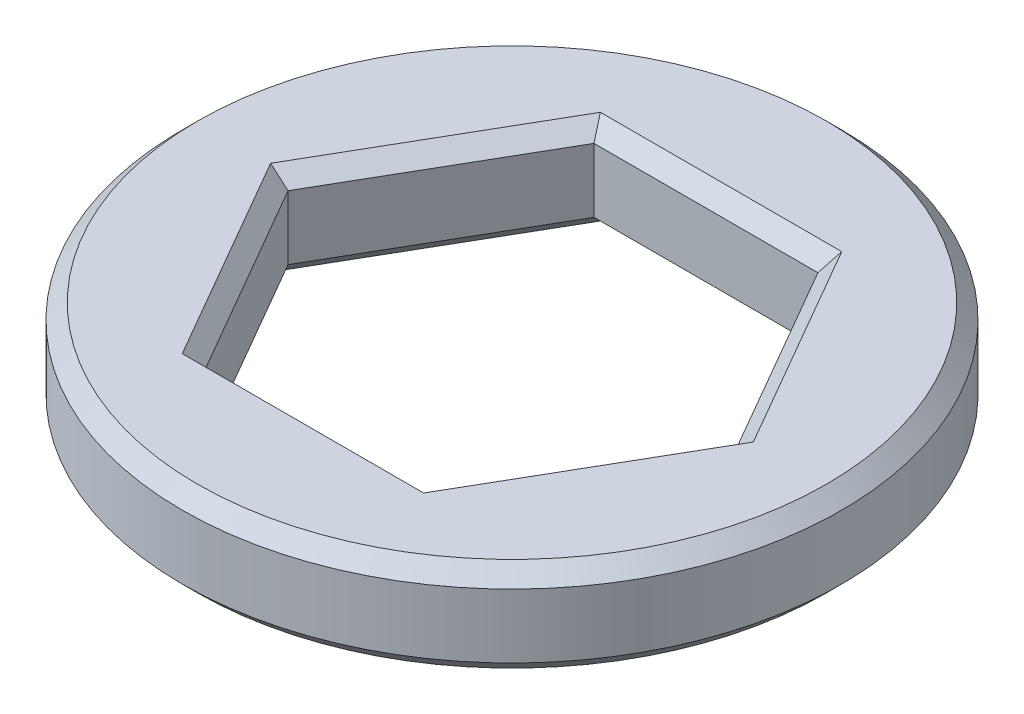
from build123d import *

# Parameters (mm, degrees)
SKETCH1_R           = 11.1125
BOSS_EXTRUDE1_DEPTH = 3.175
CHAMFER1_SIZE       = 0.508


with BuildPart() as part:
    # Sketch1 → Boss-Extrude1 (new body)
    with BuildSketch(Plane(origin=(0, 0, 0), x_dir=(1, 0, 0), z_dir=(0, 1, 0))):
        with Locations(Location((0, 0, 0), (0, 0, 270))):
            Circle(SKETCH1_R)
        Polygon((7.552318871, 0), (3.776159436, 6.5405), (-3.776159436, 6.5405), (-7.552318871, 0), (-3.776159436, -6.5405), (3.776159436, -6.5405), align=None, mode=Mode.SUBTRACT)
    extrude(amount=BOSS_EXTRUDE1_DEPTH)

    # Chamfer1
    chamfer1_edges = [part.edges().sort_by_distance(p)[0] for p in [
        (0, 0, -6.5405),
        (-5.664239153, 0, -3.27025),
        (-5.664239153, 0, 3.27025),
        (0, 0, 6.5405),
        (5.664239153, 3.175, 3.27025),
        (5.664239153, 3.175, -3.27025),
        (0, 3.175, -6.5405),
        (-5.664239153, 3.175, -3.27025),
        (-5.664239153, 3.175, 3.27025),
        (0, 3.175, 6.5405),
        (0, 0, -11.1125),
        (0, 3.175, -11.1125),
        (5.664239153, 0, 3.27025),
        (5.664239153, 0, -3.27025),
    ]]
    chamfer(chamfer1_edges, length=CHAMFER1_SIZE)


solid = part.part
